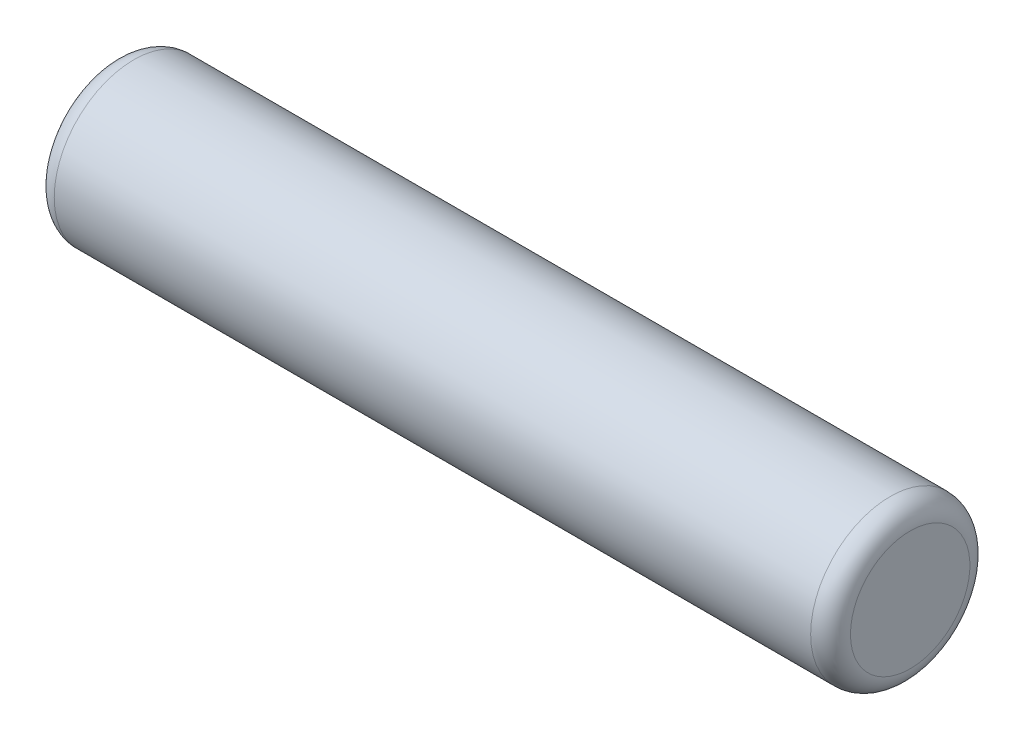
ISO-10303-21;
HEADER;
FILE_DESCRIPTION(('STEP AP214'),'2;1');
FILE_NAME('part.step','',(''),(''),'','','');
FILE_SCHEMA(('AUTOMOTIVE_DESIGN { 1 0 10303 214 1 1 1 1 }'));
ENDSEC;
DATA;
#1=APPLICATION_CONTEXT('core data for automotive mechanical design processes');
#2=APPLICATION_PROTOCOL_DEFINITION('international standard','automotive_design',2000,#1);
#3=PRODUCT_CONTEXT('',#1,'mechanical');
#4=PRODUCT('Part','Part','',(#3));
#5=PRODUCT_RELATED_PRODUCT_CATEGORY('part','',(#4));
#6=PRODUCT_DEFINITION_FORMATION('','',#4);
#7=PRODUCT_DEFINITION_CONTEXT('part definition',#1,'design');
#8=PRODUCT_DEFINITION('design','',#6,#7);
#9=PRODUCT_DEFINITION_SHAPE('','',#8);
#10=(LENGTH_UNIT() NAMED_UNIT(*) SI_UNIT(.MILLI.,.METRE.));
#11=(NAMED_UNIT(*) PLANE_ANGLE_UNIT() SI_UNIT($,.RADIAN.));
#12=(NAMED_UNIT(*) SI_UNIT($,.STERADIAN.) SOLID_ANGLE_UNIT());
#13=UNCERTAINTY_MEASURE_WITH_UNIT(LENGTH_MEASURE(1.E-05),#10,'distance_accuracy_value','');
#14=(GEOMETRIC_REPRESENTATION_CONTEXT(3) GLOBAL_UNCERTAINTY_ASSIGNED_CONTEXT((#13)) GLOBAL_UNIT_ASSIGNED_CONTEXT((#10,
#11,#12)) REPRESENTATION_CONTEXT('',''));
#15=CARTESIAN_POINT('',(0.,0.,0.));
#16=DIRECTION('',(0.,0.,1.));
#17=DIRECTION('',(1.,0.,0.));
#18=AXIS2_PLACEMENT_3D('',#15,#16,#17);
#19=CARTESIAN_POINT('',(0.,0.,0.));
#20=DIRECTION('',(1.,0.,0.));
#21=DIRECTION('',(0.,0.,-1.));
#22=AXIS2_PLACEMENT_3D('',#19,#20,#21);
#23=PLANE('',#22);
#24=CARTESIAN_POINT('',(0.,0.,0.));
#25=DIRECTION('',(1.,0.,0.));
#26=DIRECTION('',(0.,0.,-1.));
#27=AXIS2_PLACEMENT_3D('',#24,#25,#26);
#28=CIRCLE('',#27,1.5);
#29=CARTESIAN_POINT('',(0.,0.,-1.5));
#30=VERTEX_POINT('',#29);
#31=EDGE_CURVE('E29',#30,#30,#28,.F.);
#32=ORIENTED_EDGE('',*,*,#31,.T.);
#33=EDGE_LOOP('',(#32));
#34=FACE_BOUND('',#33,.T.);
#35=ADVANCED_FACE('F14',(#34),#23,.F.);
#36=CARTESIAN_POINT('',(0.,0.,0.));
#37=DIRECTION('',(-1.,0.,0.));
#38=DIRECTION('',(0.,0.,1.));
#39=AXIS2_PLACEMENT_3D('',#36,#37,#38);
#40=CYLINDRICAL_SURFACE('',#39,2.);
#41=CARTESIAN_POINT('',(0.5,0.,0.));
#42=DIRECTION('',(1.,0.,0.));
#43=DIRECTION('',(0.,0.,-1.));
#44=AXIS2_PLACEMENT_3D('',#41,#42,#43);
#45=CIRCLE('',#44,2.);
#46=CARTESIAN_POINT('',(0.5,0.,-2.));
#47=VERTEX_POINT('',#46);
#48=EDGE_CURVE('E21',#47,#47,#45,.T.);
#49=ORIENTED_EDGE('',*,*,#48,.T.);
#50=EDGE_LOOP('',(#49));
#51=FACE_BOUND('',#50,.T.);
#52=CARTESIAN_POINT('',(19.5,0.,0.));
#53=DIRECTION('',(-1.,0.,0.));
#54=DIRECTION('',(0.,0.,1.));
#55=AXIS2_PLACEMENT_3D('',#52,#53,#54);
#56=CIRCLE('',#55,2.);
#57=CARTESIAN_POINT('',(19.5,0.,2.));
#58=VERTEX_POINT('',#57);
#59=EDGE_CURVE('E25',#58,#58,#56,.T.);
#60=ORIENTED_EDGE('',*,*,#59,.T.);
#61=EDGE_LOOP('',(#60));
#62=FACE_BOUND('',#61,.T.);
#63=ADVANCED_FACE('F47',(#51,#62),#40,.T.);
#64=CARTESIAN_POINT('',(20.,2.,0.));
#65=DIRECTION('',(-1.,0.,0.));
#66=DIRECTION('',(0.,0.,1.));
#67=AXIS2_PLACEMENT_3D('',#64,#65,#66);
#68=PLANE('',#67);
#69=CARTESIAN_POINT('',(20.,0.,0.));
#70=DIRECTION('',(-1.,0.,0.));
#71=DIRECTION('',(0.,0.,1.));
#72=AXIS2_PLACEMENT_3D('',#69,#70,#71);
#73=CIRCLE('',#72,1.5);
#74=CARTESIAN_POINT('',(20.,0.,1.5));
#75=VERTEX_POINT('',#74);
#76=EDGE_CURVE('E9',#75,#75,#73,.F.);
#77=ORIENTED_EDGE('',*,*,#76,.T.);
#78=EDGE_LOOP('',(#77));
#79=FACE_BOUND('',#78,.T.);
#80=ADVANCED_FACE('F38',(#79),#68,.F.);
#81=CARTESIAN_POINT('',(0.5,0.,0.));
#82=DIRECTION('',(1.,0.,0.));
#83=DIRECTION('',(0.,0.,-1.));
#84=AXIS2_PLACEMENT_3D('',#81,#82,#83);
#85=TOROIDAL_SURFACE('',#84,1.5,0.5);
#86=ORIENTED_EDGE('',*,*,#48,.F.);
#87=EDGE_LOOP('',(#86));
#88=FACE_BOUND('',#87,.T.);
#89=ORIENTED_EDGE('',*,*,#31,.F.);
#90=EDGE_LOOP('',(#89));
#91=FACE_BOUND('',#90,.T.);
#92=ADVANCED_FACE('F36',(#88,#91),#85,.T.);
#93=CARTESIAN_POINT('',(19.5,0.,0.));
#94=DIRECTION('',(-1.,0.,0.));
#95=DIRECTION('',(0.,0.,1.));
#96=AXIS2_PLACEMENT_3D('',#93,#94,#95);
#97=TOROIDAL_SURFACE('',#96,1.5,0.5);
#98=ORIENTED_EDGE('',*,*,#76,.F.);
#99=EDGE_LOOP('',(#98));
#100=FACE_BOUND('',#99,.T.);
#101=ORIENTED_EDGE('',*,*,#59,.F.);
#102=EDGE_LOOP('',(#101));
#103=FACE_BOUND('',#102,.T.);
#104=ADVANCED_FACE('F16',(#100,#103),#97,.T.);
#105=CLOSED_SHELL('',(#35,#63,#80,#92,#104));
#106=MANIFOLD_SOLID_BREP('B1',#105);
#107=ADVANCED_BREP_SHAPE_REPRESENTATION('',(#18,#106),#14);
#108=SHAPE_DEFINITION_REPRESENTATION(#9,#107);
ENDSEC;
END-ISO-10303-21;
